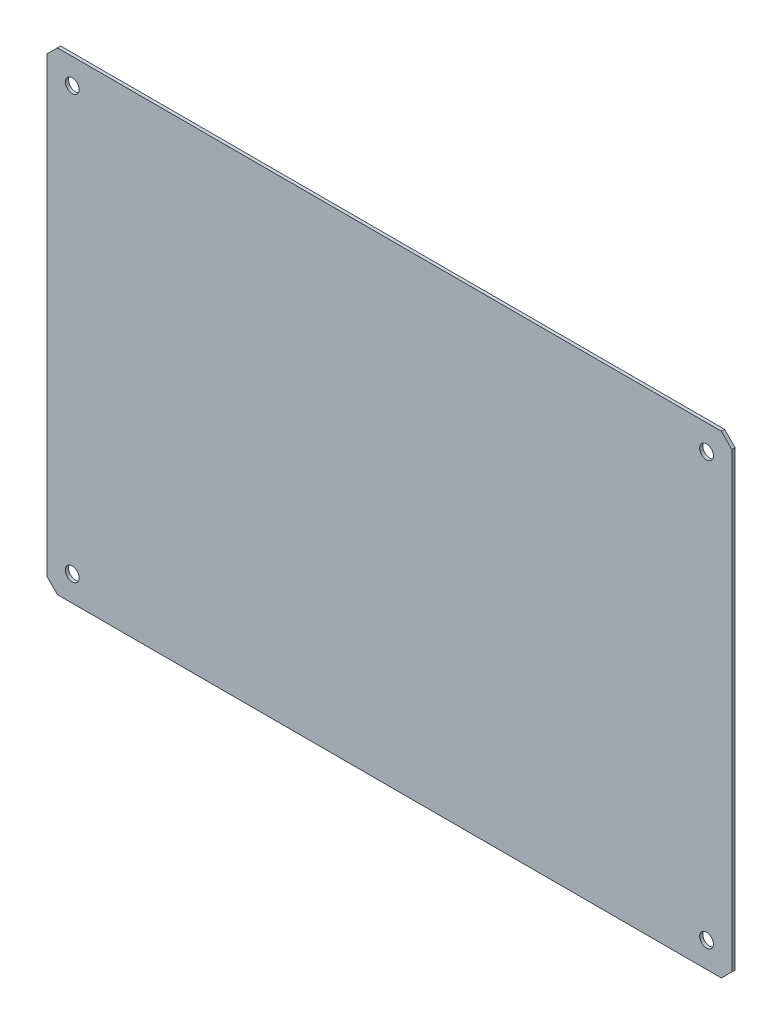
from build123d import *

# Parameters (mm, degrees)
SKETCH1_W                 = 324
SKETCH1_H                 = 224
BOSS_EXTRUDE1_DEPTH       = 1.5
SKETCH9_W                 = 3.25
SKETCH9_H                 = 2.7
DIAMETER_HOLE2_AT_2_COUNT = 2
DIAMETER_HOLE2_AT_2_PITCH = 200
DIAMETER_HOLE2_AT_3_COUNT = 2
DIAMETER_HOLE2_AT_3_PITCH = 300
DIAMETER_HOLE2_AT_4_COUNT = 2
DIAMETER_HOLE2_AT_4_PITCH = 360.555127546
CHAMFER1_SIZE             = 5


with BuildPart() as part:
    # Sketch1 → Boss-Extrude1 (new body)
    with BuildSketch(Plane.XY):
        with Locations((162, 112)):
            Rectangle(SKETCH1_W, SKETCH1_H)
    extrude(amount=BOSS_EXTRUDE1_DEPTH)

    # Sketch9 → Diameter Hole2 (revolve, cut)
    with BuildSketch(Plane(origin=(12, 212, 1.5), x_dir=(0, -1, 0), z_dir=(1, 0, 0))):
        with Locations((1.625, 0.15)):
            Rectangle(SKETCH9_W, SKETCH9_H)
    diameter_hole2 = revolve(axis=Axis((12, 212, 2.7), (0, 0, -1)), mode=Mode.SUBTRACT)

    # Diameter Hole2 at 2: Diameter Hole2 ×2
    with Locations(*[(0, -i * DIAMETER_HOLE2_AT_2_PITCH, 0) for i in range(1, DIAMETER_HOLE2_AT_2_COUNT)]):
        add(diameter_hole2, mode=Mode.SUBTRACT)

    # Diameter Hole2 at 3: Diameter Hole2 ×2
    with Locations(*[(i * DIAMETER_HOLE2_AT_3_PITCH, 0, 0) for i in range(1, DIAMETER_HOLE2_AT_3_COUNT)]):
        add(diameter_hole2, mode=Mode.SUBTRACT)

    # Diameter Hole2 at 4: Diameter Hole2 ×2
    with Locations(*[Vector(0.8320502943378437, -0.554700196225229, 0) * (i * DIAMETER_HOLE2_AT_4_PITCH) for i in range(1, DIAMETER_HOLE2_AT_4_COUNT)]):
        add(diameter_hole2, mode=Mode.SUBTRACT)

    # Chamfer1
    chamfer1_edges = [part.edges().sort_by_distance(p)[0] for p in [
        (0, 224, 0.75),
        (324, 224, 0.75),
        (324, 0, 0.75),
        (0, 0, 0.75),
    ]]
    chamfer(chamfer1_edges, length=CHAMFER1_SIZE)


solid = part.part
